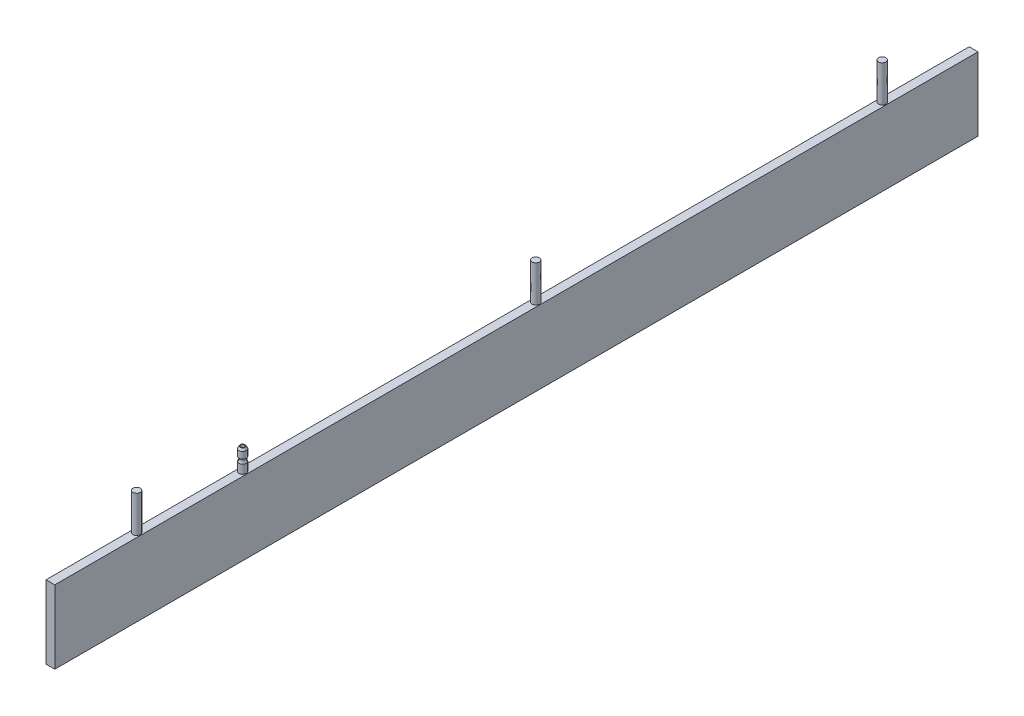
ISO-10303-21;
HEADER;
FILE_DESCRIPTION(('STEP AP214'),'2;1');
FILE_NAME('part.step','',(''),(''),'','','');
FILE_SCHEMA(('AUTOMOTIVE_DESIGN { 1 0 10303 214 1 1 1 1 }'));
ENDSEC;
DATA;
#1=APPLICATION_CONTEXT('core data for automotive mechanical design processes');
#2=APPLICATION_PROTOCOL_DEFINITION('international standard','automotive_design',2000,#1);
#3=PRODUCT_CONTEXT('',#1,'mechanical');
#4=PRODUCT('Part','Part','',(#3));
#5=PRODUCT_RELATED_PRODUCT_CATEGORY('part','',(#4));
#6=PRODUCT_DEFINITION_FORMATION('','',#4);
#7=PRODUCT_DEFINITION_CONTEXT('part definition',#1,'design');
#8=PRODUCT_DEFINITION('design','',#6,#7);
#9=PRODUCT_DEFINITION_SHAPE('','',#8);
#10=(LENGTH_UNIT() NAMED_UNIT(*) SI_UNIT(.MILLI.,.METRE.));
#11=(NAMED_UNIT(*) PLANE_ANGLE_UNIT() SI_UNIT($,.RADIAN.));
#12=(NAMED_UNIT(*) SI_UNIT($,.STERADIAN.) SOLID_ANGLE_UNIT());
#13=UNCERTAINTY_MEASURE_WITH_UNIT(LENGTH_MEASURE(1.E-05),#10,'distance_accuracy_value','');
#14=(GEOMETRIC_REPRESENTATION_CONTEXT(3) GLOBAL_UNCERTAINTY_ASSIGNED_CONTEXT((#13)) GLOBAL_UNIT_ASSIGNED_CONTEXT((#10,
#11,#12)) REPRESENTATION_CONTEXT('',''));
#15=CARTESIAN_POINT('',(0.,0.,0.));
#16=DIRECTION('',(0.,0.,1.));
#17=DIRECTION('',(1.,0.,0.));
#18=AXIS2_PLACEMENT_3D('',#15,#16,#17);
#19=CARTESIAN_POINT('',(0.,130.,1000.));
#20=DIRECTION('',(0.,-1.,0.));
#21=DIRECTION('',(0.,0.,-1.));
#22=AXIS2_PLACEMENT_3D('',#19,#20,#21);
#23=CYLINDRICAL_SURFACE('',#22,5.00000000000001);
#24=CARTESIAN_POINT('',(0.,118.,1000.));
#25=DIRECTION('',(0.,-1.,0.));
#26=DIRECTION('',(0.,0.,-1.));
#27=AXIS2_PLACEMENT_3D('',#24,#25,#26);
#28=CIRCLE('',#27,5.00000000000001);
#29=CARTESIAN_POINT('',(0.,118.,995.));
#30=VERTEX_POINT('',#29);
#31=EDGE_CURVE('E34',#30,#30,#28,.F.);
#32=ORIENTED_EDGE('',*,*,#31,.T.);
#33=EDGE_LOOP('',(#32));
#34=FACE_BOUND('',#33,.T.);
#35=CARTESIAN_POINT('',(0.,127.,1000.));
#36=DIRECTION('',(0.,1.,0.));
#37=DIRECTION('',(0.,0.,1.));
#38=AXIS2_PLACEMENT_3D('',#35,#36,#37);
#39=CIRCLE('',#38,5.00000000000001);
#40=CARTESIAN_POINT('',(0.,127.,1005.));
#41=VERTEX_POINT('',#40);
#42=EDGE_CURVE('E11',#41,#41,#39,.F.);
#43=ORIENTED_EDGE('',*,*,#42,.T.);
#44=EDGE_LOOP('',(#43));
#45=FACE_BOUND('',#44,.T.);
#46=ADVANCED_FACE('F30',(#34,#45),#23,.T.);
#47=CARTESIAN_POINT('',(0.,130.,1000.));
#48=DIRECTION('',(0.,1.,0.));
#49=DIRECTION('',(0.,0.,1.));
#50=AXIS2_PLACEMENT_3D('',#47,#48,#49);
#51=PLANE('',#50);
#52=CARTESIAN_POINT('',(0.,130.,1000.));
#53=DIRECTION('',(0.,1.,0.));
#54=DIRECTION('',(0.,0.,1.));
#55=AXIS2_PLACEMENT_3D('',#52,#53,#54);
#56=CIRCLE('',#55,2.5);
#57=CARTESIAN_POINT('',(0.,130.,1002.5));
#58=VERTEX_POINT('',#57);
#59=EDGE_CURVE('E128',#58,#58,#56,.T.);
#60=ORIENTED_EDGE('',*,*,#59,.F.);
#61=EDGE_LOOP('',(#60));
#62=FACE_BOUND('',#61,.T.);
#63=CARTESIAN_POINT('',(0.,130.,1000.));
#64=DIRECTION('',(0.,1.,0.));
#65=DIRECTION('',(0.,0.,1.));
#66=AXIS2_PLACEMENT_3D('',#63,#64,#65);
#67=CIRCLE('',#66,3.26794919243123);
#68=CARTESIAN_POINT('',(0.,130.,1003.26794919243));
#69=VERTEX_POINT('',#68);
#70=EDGE_CURVE('E40',#69,#69,#67,.T.);
#71=ORIENTED_EDGE('',*,*,#70,.T.);
#72=EDGE_LOOP('',(#71));
#73=FACE_BOUND('',#72,.T.);
#74=ADVANCED_FACE('F175',(#62,#73),#51,.T.);
#75=CARTESIAN_POINT('',(0.,130.,1000.));
#76=DIRECTION('',(0.,-1.,0.));
#77=DIRECTION('',(0.,0.,-1.));
#78=AXIS2_PLACEMENT_3D('',#75,#76,#77);
#79=CONICAL_SURFACE('',#78,3.26794919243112,0.523598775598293);
#80=ORIENTED_EDGE('',*,*,#42,.F.);
#81=EDGE_LOOP('',(#80));
#82=FACE_BOUND('',#81,.T.);
#83=ORIENTED_EDGE('',*,*,#70,.F.);
#84=EDGE_LOOP('',(#83));
#85=FACE_BOUND('',#84,.T.);
#86=ADVANCED_FACE('F32',(#82,#85),#79,.T.);
#87=CARTESIAN_POINT('',(0.,100.,1000.));
#88=DIRECTION('',(0.,1.,0.));
#89=DIRECTION('',(0.,0.,1.));
#90=AXIS2_PLACEMENT_3D('',#87,#88,#89);
#91=CYLINDRICAL_SURFACE('',#90,2.5);
#92=CARTESIAN_POINT('',(0.,100.,1000.));
#93=DIRECTION('',(0.,1.,0.));
#94=DIRECTION('',(0.,0.,1.));
#95=AXIS2_PLACEMENT_3D('',#92,#93,#94);
#96=CIRCLE('',#95,2.5);
#97=CARTESIAN_POINT('',(0.,100.,1002.5));
#98=VERTEX_POINT('',#97);
#99=EDGE_CURVE('E132',#98,#98,#96,.T.);
#100=ORIENTED_EDGE('',*,*,#99,.F.);
#101=EDGE_LOOP('',(#100));
#102=FACE_BOUND('',#101,.T.);
#103=ORIENTED_EDGE('',*,*,#59,.T.);
#104=EDGE_LOOP('',(#103));
#105=FACE_BOUND('',#104,.T.);
#106=ADVANCED_FACE('F185',(#102,#105),#91,.F.);
#107=CARTESIAN_POINT('',(0.,100.,1000.));
#108=DIRECTION('',(0.,1.,0.));
#109=DIRECTION('',(0.,0.,1.));
#110=AXIS2_PLACEMENT_3D('',#107,#108,#109);
#111=PLANE('',#110);
#112=ORIENTED_EDGE('',*,*,#99,.T.);
#113=EDGE_LOOP('',(#112));
#114=FACE_BOUND('',#113,.T.);
#115=ADVANCED_FACE('F191',(#114),#111,.T.);
#116=CARTESIAN_POINT('',(0.,115.,1000.));
#117=DIRECTION('',(0.,1.,0.));
#118=DIRECTION('',(0.,0.,1.));
#119=AXIS2_PLACEMENT_3D('',#116,#117,#118);
#120=TOROIDAL_SURFACE('',#119,8.9999999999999,5.00000000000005);
#121=CARTESIAN_POINT('',(0.,112.,1000.));
#122=DIRECTION('',(0.,1.,0.));
#123=DIRECTION('',(0.,0.,1.));
#124=AXIS2_PLACEMENT_3D('',#121,#122,#123);
#125=CIRCLE('',#124,5.00000000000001);
#126=CARTESIAN_POINT('',(0.,112.,1005.));
#127=VERTEX_POINT('',#126);
#128=EDGE_CURVE('E123',#127,#127,#125,.F.);
#129=ORIENTED_EDGE('',*,*,#128,.F.);
#130=EDGE_LOOP('',(#129));
#131=FACE_BOUND('',#130,.T.);
#132=ORIENTED_EDGE('',*,*,#31,.F.);
#133=EDGE_LOOP('',(#132));
#134=FACE_BOUND('',#133,.T.);
#135=ADVANCED_FACE('F197',(#131,#134),#120,.F.);
#136=CARTESIAN_POINT('',(0.,150.,125.));
#137=DIRECTION('',(0.,1.,0.));
#138=DIRECTION('',(0.,0.,1.));
#139=AXIS2_PLACEMENT_3D('',#136,#137,#138);
#140=PLANE('',#139);
#141=CARTESIAN_POINT('',(0.,150.,125.));
#142=DIRECTION('',(0.,1.,0.));
#143=DIRECTION('',(0.,0.,1.));
#144=AXIS2_PLACEMENT_3D('',#141,#142,#143);
#145=CIRCLE('',#144,5.00000000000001);
#146=CARTESIAN_POINT('',(0.,150.,130.));
#147=VERTEX_POINT('',#146);
#148=EDGE_CURVE('E142',#147,#147,#145,.T.);
#149=ORIENTED_EDGE('',*,*,#148,.T.);
#150=EDGE_LOOP('',(#149));
#151=FACE_BOUND('',#150,.T.);
#152=ADVANCED_FACE('F203',(#151),#140,.T.);
#153=CARTESIAN_POINT('',(6.00000000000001,0.,1263.));
#154=DIRECTION('',(0.,1.,0.));
#155=DIRECTION('',(-1.,0.,0.));
#156=AXIS2_PLACEMENT_3D('',#153,#154,#155);
#157=PLANE('',#156);
#158=DIRECTION('',(1.,0.,0.));
#159=VECTOR('',#158,1.);
#160=CARTESIAN_POINT('',(6.00000000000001,0.,0.));
#161=LINE('',#160,#159);
#162=CARTESIAN_POINT('',(-5.99999999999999,0.,0.));
#163=VERTEX_POINT('',#162);
#164=CARTESIAN_POINT('',(6.00000000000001,0.,0.));
#165=VERTEX_POINT('',#164);
#166=EDGE_CURVE('E90',#163,#165,#161,.T.);
#167=ORIENTED_EDGE('',*,*,#166,.T.);
#168=DIRECTION('',(0.,0.,-1.));
#169=VECTOR('',#168,1.);
#170=CARTESIAN_POINT('',(6.00000000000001,0.,1263.));
#171=LINE('',#170,#169);
#172=CARTESIAN_POINT('',(6.00000000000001,0.,1263.));
#173=VERTEX_POINT('',#172);
#174=EDGE_CURVE('E88',#173,#165,#171,.T.);
#175=ORIENTED_EDGE('',*,*,#174,.F.);
#176=DIRECTION('',(1.,0.,0.));
#177=VECTOR('',#176,1.);
#178=CARTESIAN_POINT('',(6.00000000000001,0.,1263.));
#179=LINE('',#178,#177);
#180=CARTESIAN_POINT('',(-5.99999999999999,0.,1263.));
#181=VERTEX_POINT('',#180);
#182=EDGE_CURVE('E80',#181,#173,#179,.T.);
#183=ORIENTED_EDGE('',*,*,#182,.F.);
#184=DIRECTION('',(0.,0.,-1.));
#185=VECTOR('',#184,1.);
#186=CARTESIAN_POINT('',(-5.99999999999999,0.,1263.));
#187=LINE('',#186,#185);
#188=EDGE_CURVE('E91',#181,#163,#187,.T.);
#189=ORIENTED_EDGE('',*,*,#188,.T.);
#190=EDGE_LOOP('',(#167,#175,#183,#189));
#191=FACE_BOUND('',#190,.T.);
#192=ADVANCED_FACE('F89',(#191),#157,.F.);
#193=CARTESIAN_POINT('',(0.,150.,599.));
#194=DIRECTION('',(0.,1.,0.));
#195=DIRECTION('',(0.,0.,1.));
#196=AXIS2_PLACEMENT_3D('',#193,#194,#195);
#197=PLANE('',#196);
#198=CARTESIAN_POINT('',(0.,150.,599.));
#199=DIRECTION('',(0.,1.,0.));
#200=DIRECTION('',(0.,0.,1.));
#201=AXIS2_PLACEMENT_3D('',#198,#199,#200);
#202=CIRCLE('',#201,5.00000000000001);
#203=CARTESIAN_POINT('',(0.,150.,604.));
#204=VERTEX_POINT('',#203);
#205=EDGE_CURVE('E103',#204,#204,#202,.T.);
#206=ORIENTED_EDGE('',*,*,#205,.T.);
#207=EDGE_LOOP('',(#206));
#208=FACE_BOUND('',#207,.T.);
#209=ADVANCED_FACE('F148',(#208),#197,.T.);
#210=CARTESIAN_POINT('',(1.49956864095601E-13,150.,1145.));
#211=DIRECTION('',(0.,1.,0.));
#212=DIRECTION('',(0.,0.,1.));
#213=AXIS2_PLACEMENT_3D('',#210,#211,#212);
#214=PLANE('',#213);
#215=CARTESIAN_POINT('',(1.49956864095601E-13,150.,1145.));
#216=DIRECTION('',(0.,1.,0.));
#217=DIRECTION('',(0.,0.,1.));
#218=AXIS2_PLACEMENT_3D('',#215,#216,#217);
#219=CIRCLE('',#218,5.00000000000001);
#220=CARTESIAN_POINT('',(1.49956864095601E-13,150.,1150.));
#221=VERTEX_POINT('',#220);
#222=EDGE_CURVE('E137',#221,#221,#219,.T.);
#223=ORIENTED_EDGE('',*,*,#222,.T.);
#224=EDGE_LOOP('',(#223));
#225=FACE_BOUND('',#224,.T.);
#226=ADVANCED_FACE('F220',(#225),#214,.T.);
#227=CARTESIAN_POINT('',(0.,150.,125.));
#228=DIRECTION('',(0.,-1.,0.));
#229=DIRECTION('',(0.,0.,-1.));
#230=AXIS2_PLACEMENT_3D('',#227,#228,#229);
#231=CYLINDRICAL_SURFACE('',#230,5.00000000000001);
#232=ORIENTED_EDGE('',*,*,#148,.F.);
#233=EDGE_LOOP('',(#232));
#234=FACE_BOUND('',#233,.T.);
#235=CARTESIAN_POINT('',(0.,100.,125.));
#236=DIRECTION('',(0.,-1.,0.));
#237=DIRECTION('',(0.,0.,-1.));
#238=AXIS2_PLACEMENT_3D('',#235,#236,#237);
#239=CIRCLE('',#238,5.00000000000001);
#240=CARTESIAN_POINT('',(0.,100.,120.));
#241=VERTEX_POINT('',#240);
#242=EDGE_CURVE('E113',#241,#241,#239,.F.);
#243=ORIENTED_EDGE('',*,*,#242,.T.);
#244=EDGE_LOOP('',(#243));
#245=FACE_BOUND('',#244,.T.);
#246=ADVANCED_FACE('F217',(#234,#245),#231,.T.);
#247=CARTESIAN_POINT('',(6.,100.,1263.));
#248=DIRECTION('',(-1.,0.,0.));
#249=DIRECTION('',(0.,-1.,0.));
#250=AXIS2_PLACEMENT_3D('',#247,#248,#249);
#251=PLANE('',#250);
#252=DIRECTION('',(0.,1.,0.));
#253=VECTOR('',#252,1.);
#254=CARTESIAN_POINT('',(6.,100.,0.));
#255=LINE('',#254,#253);
#256=CARTESIAN_POINT('',(6.,100.,0.));
#257=VERTEX_POINT('',#256);
#258=EDGE_CURVE('E66',#165,#257,#255,.T.);
#259=ORIENTED_EDGE('',*,*,#258,.T.);
#260=DIRECTION('',(0.,0.,-1.));
#261=VECTOR('',#260,1.);
#262=CARTESIAN_POINT('',(6.,100.,1263.));
#263=LINE('',#262,#261);
#264=CARTESIAN_POINT('',(6.,100.,1263.));
#265=VERTEX_POINT('',#264);
#266=EDGE_CURVE('E92',#265,#257,#263,.T.);
#267=ORIENTED_EDGE('',*,*,#266,.F.);
#268=DIRECTION('',(0.,1.,0.));
#269=VECTOR('',#268,1.);
#270=CARTESIAN_POINT('',(6.,100.,1263.));
#271=LINE('',#270,#269);
#272=EDGE_CURVE('E83',#173,#265,#271,.T.);
#273=ORIENTED_EDGE('',*,*,#272,.F.);
#274=ORIENTED_EDGE('',*,*,#174,.T.);
#275=EDGE_LOOP('',(#259,#267,#273,#274));
#276=FACE_BOUND('',#275,.T.);
#277=ADVANCED_FACE('F94',(#276),#251,.F.);
#278=CARTESIAN_POINT('',(-5.99999999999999,0.,1263.));
#279=DIRECTION('',(0.,0.,-1.));
#280=DIRECTION('',(-1.,0.,0.));
#281=AXIS2_PLACEMENT_3D('',#278,#279,#280);
#282=PLANE('',#281);
#283=DIRECTION('',(0.,-1.,0.));
#284=VECTOR('',#283,1.);
#285=CARTESIAN_POINT('',(-6.,100.,1263.));
#286=LINE('',#285,#284);
#287=CARTESIAN_POINT('',(-6.,100.,1263.));
#288=VERTEX_POINT('',#287);
#289=EDGE_CURVE('E85',#288,#181,#286,.T.);
#290=ORIENTED_EDGE('',*,*,#289,.T.);
#291=ORIENTED_EDGE('',*,*,#182,.T.);
#292=ORIENTED_EDGE('',*,*,#272,.T.);
#293=DIRECTION('',(-1.,0.,0.));
#294=VECTOR('',#293,1.);
#295=CARTESIAN_POINT('',(-6.,100.,1263.));
#296=LINE('',#295,#294);
#297=EDGE_CURVE('E49',#265,#288,#296,.T.);
#298=ORIENTED_EDGE('',*,*,#297,.T.);
#299=EDGE_LOOP('',(#290,#291,#292,#298));
#300=FACE_BOUND('',#299,.T.);
#301=ADVANCED_FACE('F81',(#300),#282,.F.);
#302=CARTESIAN_POINT('',(-6.,100.,1263.));
#303=DIRECTION('',(1.,0.,0.));
#304=DIRECTION('',(0.,1.,0.));
#305=AXIS2_PLACEMENT_3D('',#302,#303,#304);
#306=PLANE('',#305);
#307=DIRECTION('',(0.,-1.,0.));
#308=VECTOR('',#307,1.);
#309=CARTESIAN_POINT('',(-6.,100.,0.));
#310=LINE('',#309,#308);
#311=CARTESIAN_POINT('',(-6.,100.,0.));
#312=VERTEX_POINT('',#311);
#313=EDGE_CURVE('E100',#312,#163,#310,.T.);
#314=ORIENTED_EDGE('',*,*,#313,.T.);
#315=ORIENTED_EDGE('',*,*,#188,.F.);
#316=ORIENTED_EDGE('',*,*,#289,.F.);
#317=DIRECTION('',(0.,0.,-1.));
#318=VECTOR('',#317,1.);
#319=CARTESIAN_POINT('',(-6.,100.,1263.));
#320=LINE('',#319,#318);
#321=EDGE_CURVE('E96',#288,#312,#320,.T.);
#322=ORIENTED_EDGE('',*,*,#321,.T.);
#323=EDGE_LOOP('',(#314,#315,#316,#322));
#324=FACE_BOUND('',#323,.T.);
#325=ADVANCED_FACE('F226',(#324),#306,.F.);
#326=CARTESIAN_POINT('',(-5.99999999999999,0.,0.));
#327=DIRECTION('',(0.,0.,-1.));
#328=DIRECTION('',(-1.,0.,0.));
#329=AXIS2_PLACEMENT_3D('',#326,#327,#328);
#330=PLANE('',#329);
#331=ORIENTED_EDGE('',*,*,#313,.F.);
#332=DIRECTION('',(-1.,0.,0.));
#333=VECTOR('',#332,1.);
#334=CARTESIAN_POINT('',(-6.,100.,0.));
#335=LINE('',#334,#333);
#336=EDGE_CURVE('E72',#257,#312,#335,.T.);
#337=ORIENTED_EDGE('',*,*,#336,.F.);
#338=ORIENTED_EDGE('',*,*,#258,.F.);
#339=ORIENTED_EDGE('',*,*,#166,.F.);
#340=EDGE_LOOP('',(#331,#337,#338,#339));
#341=FACE_BOUND('',#340,.T.);
#342=ADVANCED_FACE('F154',(#341),#330,.T.);
#343=CARTESIAN_POINT('',(0.,150.,599.));
#344=DIRECTION('',(0.,-1.,0.));
#345=DIRECTION('',(0.,0.,-1.));
#346=AXIS2_PLACEMENT_3D('',#343,#344,#345);
#347=CYLINDRICAL_SURFACE('',#346,5.00000000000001);
#348=ORIENTED_EDGE('',*,*,#205,.F.);
#349=EDGE_LOOP('',(#348));
#350=FACE_BOUND('',#349,.T.);
#351=CARTESIAN_POINT('',(0.,100.,599.));
#352=DIRECTION('',(0.,-1.,0.));
#353=DIRECTION('',(0.,0.,-1.));
#354=AXIS2_PLACEMENT_3D('',#351,#352,#353);
#355=CIRCLE('',#354,5.00000000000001);
#356=CARTESIAN_POINT('',(0.,100.,594.));
#357=VERTEX_POINT('',#356);
#358=EDGE_CURVE('E110',#357,#357,#355,.F.);
#359=ORIENTED_EDGE('',*,*,#358,.T.);
#360=EDGE_LOOP('',(#359));
#361=FACE_BOUND('',#360,.T.);
#362=ADVANCED_FACE('F150',(#350,#361),#347,.T.);
#363=CARTESIAN_POINT('',(1.49956864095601E-13,150.,1145.));
#364=DIRECTION('',(0.,-1.,0.));
#365=DIRECTION('',(0.,0.,-1.));
#366=AXIS2_PLACEMENT_3D('',#363,#364,#365);
#367=CYLINDRICAL_SURFACE('',#366,5.00000000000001);
#368=ORIENTED_EDGE('',*,*,#222,.F.);
#369=EDGE_LOOP('',(#368));
#370=FACE_BOUND('',#369,.T.);
#371=CARTESIAN_POINT('',(1.49956864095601E-13,100.,1145.));
#372=DIRECTION('',(0.,-1.,0.));
#373=DIRECTION('',(0.,0.,-1.));
#374=AXIS2_PLACEMENT_3D('',#371,#372,#373);
#375=CIRCLE('',#374,5.00000000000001);
#376=CARTESIAN_POINT('',(1.49956864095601E-13,100.,1140.));
#377=VERTEX_POINT('',#376);
#378=EDGE_CURVE('E116',#377,#377,#375,.F.);
#379=ORIENTED_EDGE('',*,*,#378,.T.);
#380=EDGE_LOOP('',(#379));
#381=FACE_BOUND('',#380,.T.);
#382=ADVANCED_FACE('F153',(#370,#381),#367,.T.);
#383=CARTESIAN_POINT('',(-6.,100.,1263.));
#384=DIRECTION('',(0.,-1.,0.));
#385=DIRECTION('',(0.,0.,-1.));
#386=AXIS2_PLACEMENT_3D('',#383,#384,#385);
#387=PLANE('',#386);
#388=ORIENTED_EDGE('',*,*,#378,.F.);
#389=EDGE_LOOP('',(#388));
#390=FACE_BOUND('',#389,.T.);
#391=ORIENTED_EDGE('',*,*,#358,.F.);
#392=EDGE_LOOP('',(#391));
#393=FACE_BOUND('',#392,.T.);
#394=ORIENTED_EDGE('',*,*,#336,.T.);
#395=ORIENTED_EDGE('',*,*,#321,.F.);
#396=ORIENTED_EDGE('',*,*,#297,.F.);
#397=ORIENTED_EDGE('',*,*,#266,.T.);
#398=EDGE_LOOP('',(#394,#395,#396,#397));
#399=FACE_BOUND('',#398,.T.);
#400=ORIENTED_EDGE('',*,*,#242,.F.);
#401=EDGE_LOOP('',(#400));
#402=FACE_BOUND('',#401,.T.);
#403=CARTESIAN_POINT('',(0.,100.,1000.));
#404=DIRECTION('',(0.,-1.,0.));
#405=DIRECTION('',(0.,0.,-1.));
#406=AXIS2_PLACEMENT_3D('',#403,#404,#405);
#407=CIRCLE('',#406,5.00000000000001);
#408=CARTESIAN_POINT('',(0.,100.,995.));
#409=VERTEX_POINT('',#408);
#410=EDGE_CURVE('E119',#409,#409,#407,.F.);
#411=ORIENTED_EDGE('',*,*,#410,.F.);
#412=EDGE_LOOP('',(#411));
#413=FACE_BOUND('',#412,.T.);
#414=ADVANCED_FACE('F158',(#390,#393,#399,#402,#413),#387,.F.);
#415=ORIENTED_EDGE('',*,*,#128,.T.);
#416=EDGE_LOOP('',(#415));
#417=FACE_BOUND('',#416,.T.);
#418=ORIENTED_EDGE('',*,*,#410,.T.);
#419=EDGE_LOOP('',(#418));
#420=FACE_BOUND('',#419,.T.);
#421=ADVANCED_FACE('F160',(#417,#420),#23,.T.);
#422=CLOSED_SHELL('',(#46,#74,#86,#106,#115,#135,#152,#192,#209,#226,#246,#277,#301,#325,#342,
#362,#382,#414,#421));
#423=MANIFOLD_SOLID_BREP('B2',#422);
#424=ADVANCED_BREP_SHAPE_REPRESENTATION('',(#18,#423),#14);
#425=SHAPE_DEFINITION_REPRESENTATION(#9,#424);
ENDSEC;
END-ISO-10303-21;
